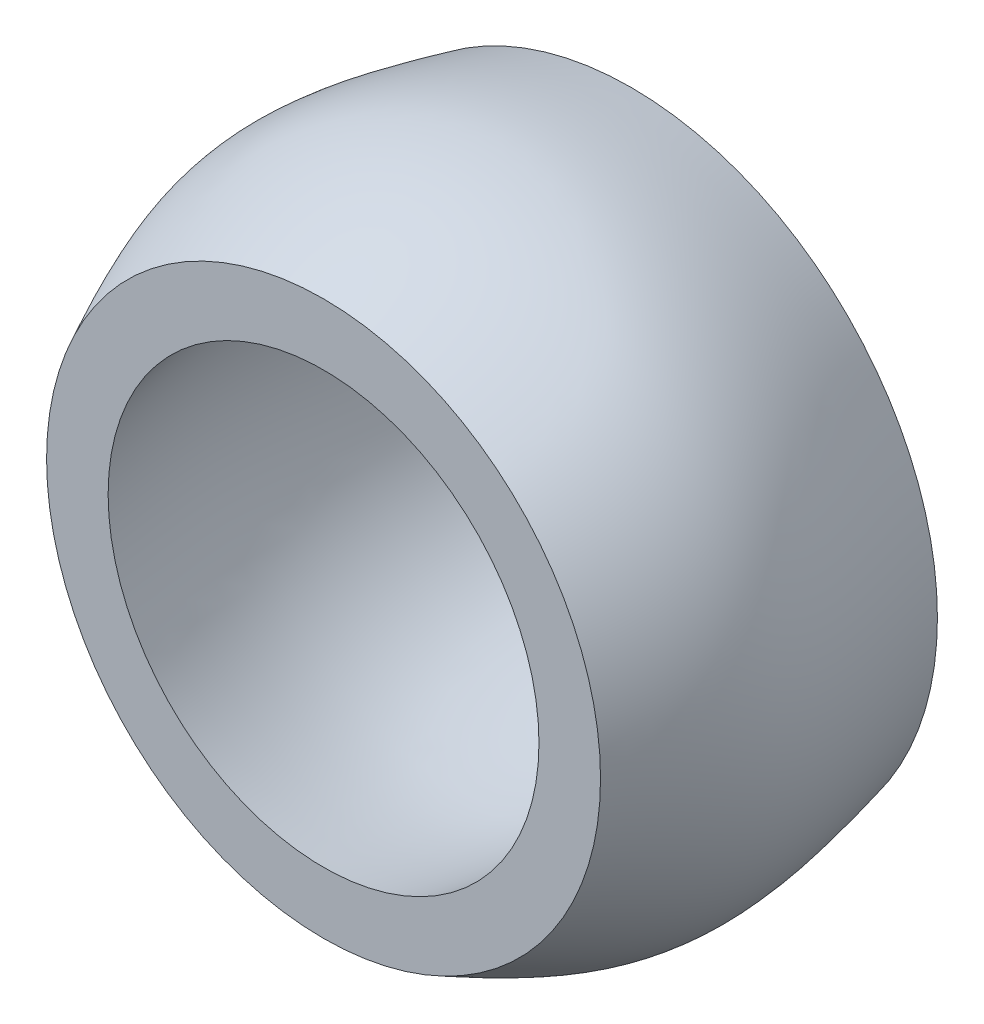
ISO-10303-21;
HEADER;
FILE_DESCRIPTION(('STEP AP214'),'2;1');
FILE_NAME('part.step','',(''),(''),'','','');
FILE_SCHEMA(('AUTOMOTIVE_DESIGN { 1 0 10303 214 1 1 1 1 }'));
ENDSEC;
DATA;
#1=APPLICATION_CONTEXT('core data for automotive mechanical design processes');
#2=APPLICATION_PROTOCOL_DEFINITION('international standard','automotive_design',2000,#1);
#3=PRODUCT_CONTEXT('',#1,'mechanical');
#4=PRODUCT('Part','Part','',(#3));
#5=PRODUCT_RELATED_PRODUCT_CATEGORY('part','',(#4));
#6=PRODUCT_DEFINITION_FORMATION('','',#4);
#7=PRODUCT_DEFINITION_CONTEXT('part definition',#1,'design');
#8=PRODUCT_DEFINITION('design','',#6,#7);
#9=PRODUCT_DEFINITION_SHAPE('','',#8);
#10=(LENGTH_UNIT() NAMED_UNIT(*) SI_UNIT(.MILLI.,.METRE.));
#11=(NAMED_UNIT(*) PLANE_ANGLE_UNIT() SI_UNIT($,.RADIAN.));
#12=(NAMED_UNIT(*) SI_UNIT($,.STERADIAN.) SOLID_ANGLE_UNIT());
#13=UNCERTAINTY_MEASURE_WITH_UNIT(LENGTH_MEASURE(1.E-05),#10,'distance_accuracy_value','');
#14=(GEOMETRIC_REPRESENTATION_CONTEXT(3) GLOBAL_UNCERTAINTY_ASSIGNED_CONTEXT((#13)) GLOBAL_UNIT_ASSIGNED_CONTEXT((#10,
#11,#12)) REPRESENTATION_CONTEXT('',''));
#15=CARTESIAN_POINT('',(0.,0.,0.));
#16=DIRECTION('',(0.,0.,1.));
#17=DIRECTION('',(1.,0.,0.));
#18=AXIS2_PLACEMENT_3D('',#15,#16,#17);
#19=CARTESIAN_POINT('',(14.,0.,0.));
#20=CARTESIAN_POINT('',(14.547318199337,0.,3.92036852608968));
#21=CARTESIAN_POINT('',(15.4802795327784,0.,10.6030482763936));
#22=CARTESIAN_POINT('',(14.4329271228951,0.,17.2517384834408));
#23=CARTESIAN_POINT('',(14.,0.,20.));
#24=B_SPLINE_CURVE_WITH_KNOTS('',3,(#19,#20,#21,#22,#23),.UNSPECIFIED.,.F.,.F.,(4,1,4),(0.,
0.586646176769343,1.),.UNSPECIFIED.);
#25=CARTESIAN_POINT('',(0.,0.,0.));
#26=DIRECTION('',(0.,0.,-1.));
#27=AXIS1_PLACEMENT('',#25,#26);
#28=SURFACE_OF_REVOLUTION('',#24,#27);
#29=CARTESIAN_POINT('',(0.,0.,20.));
#30=DIRECTION('',(0.,0.,-1.));
#31=DIRECTION('',(-1.,0.,0.));
#32=AXIS2_PLACEMENT_3D('',#29,#30,#31);
#33=CIRCLE('',#32,14.);
#34=CARTESIAN_POINT('',(-14.,0.,20.));
#35=VERTEX_POINT('',#34);
#36=EDGE_CURVE('E10',#35,#35,#33,.T.);
#37=ORIENTED_EDGE('',*,*,#36,.F.);
#38=EDGE_LOOP('',(#37));
#39=FACE_BOUND('',#38,.T.);
#40=CARTESIAN_POINT('',(0.,0.,0.));
#41=DIRECTION('',(0.,0.,-1.));
#42=DIRECTION('',(-1.,0.,0.));
#43=AXIS2_PLACEMENT_3D('',#40,#41,#42);
#44=CIRCLE('',#43,14.);
#45=CARTESIAN_POINT('',(-14.,0.,0.));
#46=VERTEX_POINT('',#45);
#47=EDGE_CURVE('E40',#46,#46,#44,.T.);
#48=ORIENTED_EDGE('',*,*,#47,.T.);
#49=EDGE_LOOP('',(#48));
#50=FACE_BOUND('',#49,.T.);
#51=ADVANCED_FACE('F25',(#39,#50),#28,.T.);
#52=CARTESIAN_POINT('',(14.,0.,20.));
#53=DIRECTION('',(0.,0.,-1.));
#54=DIRECTION('',(-1.,0.,0.));
#55=AXIS2_PLACEMENT_3D('',#52,#53,#54);
#56=PLANE('',#55);
#57=CARTESIAN_POINT('',(0.,0.,20.));
#58=DIRECTION('',(0.,0.,-1.));
#59=DIRECTION('',(-1.,0.,0.));
#60=AXIS2_PLACEMENT_3D('',#57,#58,#59);
#61=CIRCLE('',#60,18.);
#62=CARTESIAN_POINT('',(-18.,0.,20.));
#63=VERTEX_POINT('',#62);
#64=EDGE_CURVE('E32',#63,#63,#61,.T.);
#65=ORIENTED_EDGE('',*,*,#64,.F.);
#66=EDGE_LOOP('',(#65));
#67=FACE_BOUND('',#66,.T.);
#68=ORIENTED_EDGE('',*,*,#36,.T.);
#69=EDGE_LOOP('',(#68));
#70=FACE_BOUND('',#69,.T.);
#71=ADVANCED_FACE('F59',(#67,#70),#56,.F.);
#72=CARTESIAN_POINT('',(18.,0.,20.));
#73=CARTESIAN_POINT('',(19.3405037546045,0.,17.2875974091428));
#74=CARTESIAN_POINT('',(22.474709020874,0.,10.9457826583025));
#75=CARTESIAN_POINT('',(20.8329723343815,0.,3.9841392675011));
#76=CARTESIAN_POINT('',(19.8934086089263,0.,0.));
#77=B_SPLINE_CURVE_WITH_KNOTS('',3,(#72,#73,#74,#75,#76),.UNSPECIFIED.,.F.,.F.,(4,1,4),(0.,
0.427701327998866,1.),.UNSPECIFIED.);
#78=CARTESIAN_POINT('',(0.,0.,0.));
#79=DIRECTION('',(0.,0.,-1.));
#80=AXIS1_PLACEMENT('',#78,#79);
#81=SURFACE_OF_REVOLUTION('',#77,#80);
#82=CARTESIAN_POINT('',(0.,0.,0.));
#83=DIRECTION('',(0.,0.,-1.));
#84=DIRECTION('',(-1.,0.,0.));
#85=AXIS2_PLACEMENT_3D('',#82,#83,#84);
#86=CIRCLE('',#85,19.8934086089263);
#87=CARTESIAN_POINT('',(-19.8934086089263,0.,0.));
#88=VERTEX_POINT('',#87);
#89=EDGE_CURVE('E36',#88,#88,#86,.T.);
#90=ORIENTED_EDGE('',*,*,#89,.F.);
#91=EDGE_LOOP('',(#90));
#92=FACE_BOUND('',#91,.T.);
#93=ORIENTED_EDGE('',*,*,#64,.T.);
#94=EDGE_LOOP('',(#93));
#95=FACE_BOUND('',#94,.T.);
#96=ADVANCED_FACE('F55',(#92,#95),#81,.T.);
#97=CARTESIAN_POINT('',(14.,0.,0.));
#98=DIRECTION('',(0.,0.,1.));
#99=DIRECTION('',(1.,0.,0.));
#100=AXIS2_PLACEMENT_3D('',#97,#98,#99);
#101=PLANE('',#100);
#102=ORIENTED_EDGE('',*,*,#47,.F.);
#103=EDGE_LOOP('',(#102));
#104=FACE_BOUND('',#103,.T.);
#105=ORIENTED_EDGE('',*,*,#89,.T.);
#106=EDGE_LOOP('',(#105));
#107=FACE_BOUND('',#106,.T.);
#108=ADVANCED_FACE('F58',(#104,#107),#101,.F.);
#109=CLOSED_SHELL('',(#51,#71,#96,#108));
#110=MANIFOLD_SOLID_BREP('B2',#109);
#111=ADVANCED_BREP_SHAPE_REPRESENTATION('',(#18,#110),#14);
#112=SHAPE_DEFINITION_REPRESENTATION(#9,#111);
ENDSEC;
END-ISO-10303-21;
